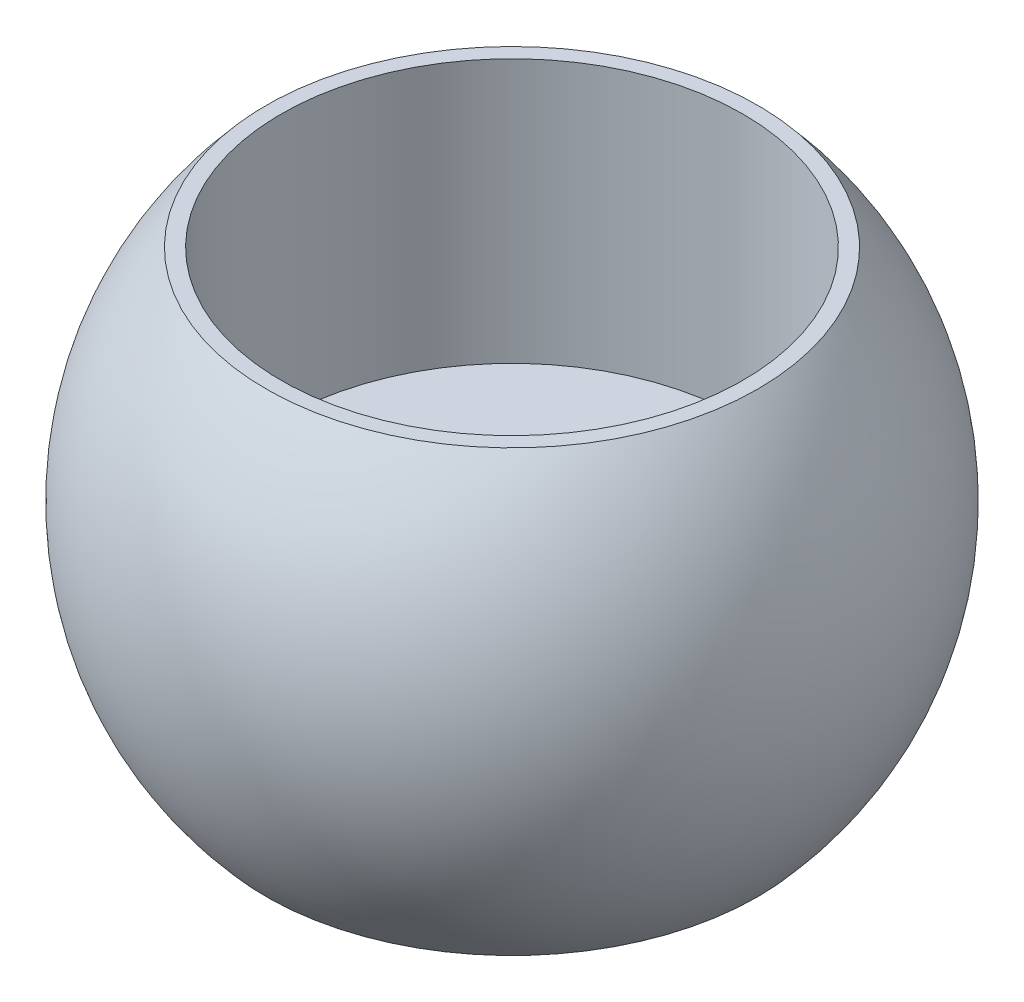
from build123d import *


with BuildPart() as part:
    # Schizzo1 → Rivoluzione1 (revolve)
    with BuildSketch(Plane.XY, mode=Mode.PRIVATE) as rivoluzione1_sk:
        with BuildLine():
            Line((5.5, -2), (5.5, -5))
            Line((5.5, -5), (11, -10))
            Line((11, -10), (11.180339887, -10))
            ThreePointArc((11.180339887, -10), (15, 0), (11.180339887, 10))
            Line((11.180339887, 10), (10.5, 10))
            Line((10.5, 10), (10.5, -2))
            Line((10.5, -2), (5.5, -2))
        make_face()
    revolve(rivoluzione1_sk.sketch.rotate(Axis((0, -86, 0), (0, 1, 0)), 90), axis=Axis((0, -86, 0), (0, 1, 0)))


solid = part.part
